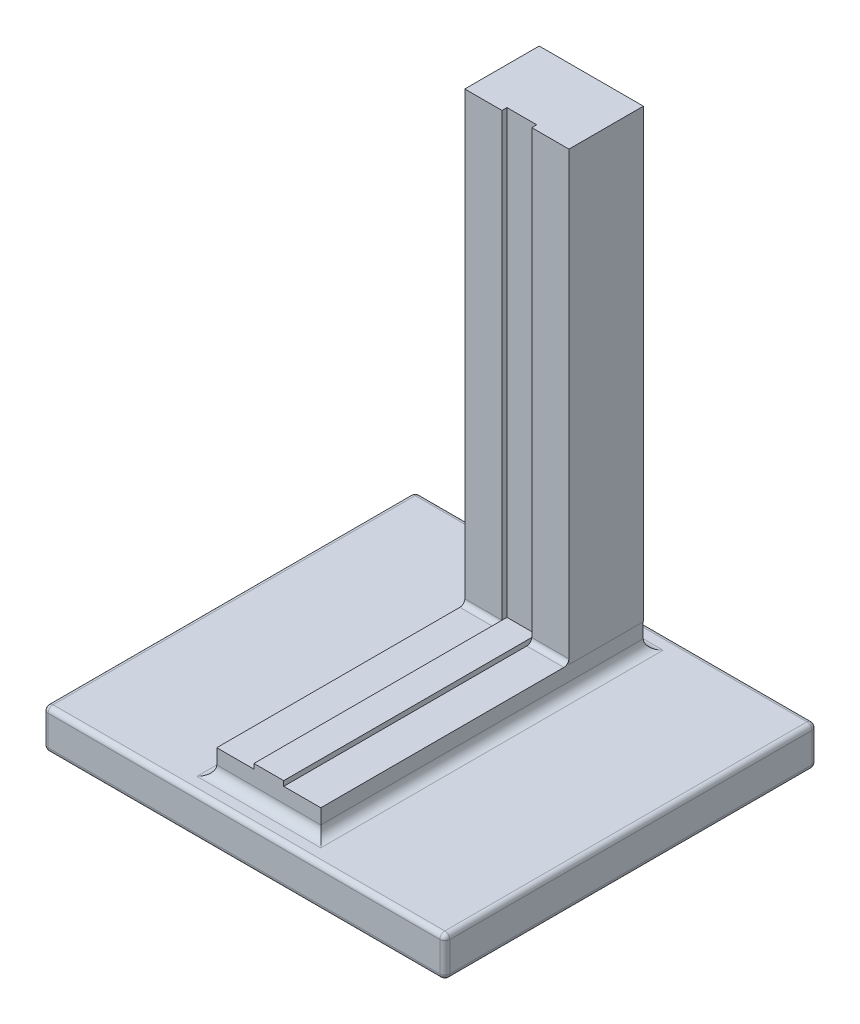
ISO-10303-21;
HEADER;
FILE_DESCRIPTION(('STEP AP214'),'2;1');
FILE_NAME('part.step','',(''),(''),'','','');
FILE_SCHEMA(('AUTOMOTIVE_DESIGN { 1 0 10303 214 1 1 1 1 }'));
ENDSEC;
DATA;
#1=APPLICATION_CONTEXT('core data for automotive mechanical design processes');
#2=APPLICATION_PROTOCOL_DEFINITION('international standard','automotive_design',2000,#1);
#3=PRODUCT_CONTEXT('',#1,'mechanical');
#4=PRODUCT('Part','Part','',(#3));
#5=PRODUCT_RELATED_PRODUCT_CATEGORY('part','',(#4));
#6=PRODUCT_DEFINITION_FORMATION('','',#4);
#7=PRODUCT_DEFINITION_CONTEXT('part definition',#1,'design');
#8=PRODUCT_DEFINITION('design','',#6,#7);
#9=PRODUCT_DEFINITION_SHAPE('','',#8);
#10=(LENGTH_UNIT() NAMED_UNIT(*) SI_UNIT(.MILLI.,.METRE.));
#11=(NAMED_UNIT(*) PLANE_ANGLE_UNIT() SI_UNIT($,.RADIAN.));
#12=(NAMED_UNIT(*) SI_UNIT($,.STERADIAN.) SOLID_ANGLE_UNIT());
#13=UNCERTAINTY_MEASURE_WITH_UNIT(LENGTH_MEASURE(1.E-05),#10,'distance_accuracy_value','');
#14=(GEOMETRIC_REPRESENTATION_CONTEXT(3) GLOBAL_UNCERTAINTY_ASSIGNED_CONTEXT((#13)) GLOBAL_UNIT_ASSIGNED_CONTEXT((#10,
#11,#12)) REPRESENTATION_CONTEXT('',''));
#15=CARTESIAN_POINT('',(0.,0.,0.));
#16=DIRECTION('',(0.,0.,1.));
#17=DIRECTION('',(1.,0.,0.));
#18=AXIS2_PLACEMENT_3D('',#15,#16,#17);
#19=CARTESIAN_POINT('',(0.,0.,1300.));
#20=DIRECTION('',(0.,-1.,0.));
#21=DIRECTION('',(0.,0.,-1.));
#22=AXIS2_PLACEMENT_3D('',#19,#20,#21);
#23=PLANE('',#22);
#24=DIRECTION('',(0.,0.,1.));
#25=VECTOR('',#24,1.);
#26=CARTESIAN_POINT('',(150.,0.,250.));
#27=LINE('',#26,#25);
#28=CARTESIAN_POINT('',(150.,0.,320.));
#29=VERTEX_POINT('',#28);
#30=CARTESIAN_POINT('',(150.,0.,1300.));
#31=VERTEX_POINT('',#30);
#32=EDGE_CURVE('E236',#29,#31,#27,.T.);
#33=ORIENTED_EDGE('',*,*,#32,.F.);
#34=DIRECTION('',(1.,0.,0.));
#35=VECTOR('',#34,1.);
#36=CARTESIAN_POINT('',(0.,0.,320.));
#37=LINE('',#36,#35);
#38=CARTESIAN_POINT('',(0.,0.,320.));
#39=VERTEX_POINT('',#38);
#40=EDGE_CURVE('E342',#29,#39,#37,.F.);
#41=ORIENTED_EDGE('',*,*,#40,.T.);
#42=DIRECTION('',(0.,0.,-1.));
#43=VECTOR('',#42,1.);
#44=CARTESIAN_POINT('',(0.,0.,1300.));
#45=LINE('',#44,#43);
#46=CARTESIAN_POINT('',(0.,0.,1300.));
#47=VERTEX_POINT('',#46);
#48=EDGE_CURVE('E253',#47,#39,#45,.T.);
#49=ORIENTED_EDGE('',*,*,#48,.F.);
#50=DIRECTION('',(-1.,0.,0.));
#51=VECTOR('',#50,1.);
#52=CARTESIAN_POINT('',(0.,0.,1300.));
#53=LINE('',#52,#51);
#54=EDGE_CURVE('E254',#31,#47,#53,.T.);
#55=ORIENTED_EDGE('',*,*,#54,.F.);
#56=EDGE_LOOP('',(#33,#41,#49,#55));
#57=FACE_BOUND('',#56,.T.);
#58=ADVANCED_FACE('F26',(#57),#23,.F.);
#59=CARTESIAN_POINT('',(0.,1800.,300.));
#60=DIRECTION('',(0.,0.,-1.));
#61=DIRECTION('',(-1.,0.,0.));
#62=AXIS2_PLACEMENT_3D('',#59,#60,#61);
#63=PLANE('',#62);
#64=DIRECTION('',(0.,-1.,0.));
#65=VECTOR('',#64,1.);
#66=CARTESIAN_POINT('',(0.,0.,300.));
#67=LINE('',#66,#65);
#68=CARTESIAN_POINT('',(0.,1800.,300.));
#69=VERTEX_POINT('',#68);
#70=CARTESIAN_POINT('',(0.,20.,300.));
#71=VERTEX_POINT('',#70);
#72=EDGE_CURVE('E303',#69,#71,#67,.T.);
#73=ORIENTED_EDGE('',*,*,#72,.T.);
#74=DIRECTION('',(1.,0.,0.));
#75=VECTOR('',#74,1.);
#76=CARTESIAN_POINT('',(150.,20.,300.));
#77=LINE('',#76,#75);
#78=CARTESIAN_POINT('',(150.,20.,300.));
#79=VERTEX_POINT('',#78);
#80=EDGE_CURVE('E337',#71,#79,#77,.T.);
#81=ORIENTED_EDGE('',*,*,#80,.T.);
#82=DIRECTION('',(0.,-1.,0.));
#83=VECTOR('',#82,1.);
#84=CARTESIAN_POINT('',(150.,1800.,300.));
#85=LINE('',#84,#83);
#86=CARTESIAN_POINT('',(150.,1800.,300.));
#87=VERTEX_POINT('',#86);
#88=EDGE_CURVE('E266',#87,#79,#85,.T.);
#89=ORIENTED_EDGE('',*,*,#88,.F.);
#90=DIRECTION('',(-1.,0.,0.));
#91=VECTOR('',#90,1.);
#92=CARTESIAN_POINT('',(0.,1800.,300.));
#93=LINE('',#92,#91);
#94=EDGE_CURVE('E513',#87,#69,#93,.T.);
#95=ORIENTED_EDGE('',*,*,#94,.T.);
#96=EDGE_LOOP('',(#73,#81,#89,#95));
#97=FACE_BOUND('',#96,.T.);
#98=ADVANCED_FACE('F522',(#97),#63,.F.);
#99=CARTESIAN_POINT('',(0.,0.,300.));
#100=DIRECTION('',(1.,0.,0.));
#101=DIRECTION('',(0.,0.,-1.));
#102=AXIS2_PLACEMENT_3D('',#99,#100,#101);
#103=PLANE('',#102);
#104=DIRECTION('',(0.,-1.,0.));
#105=VECTOR('',#104,1.);
#106=CARTESIAN_POINT('',(0.,0.,0.));
#107=LINE('',#106,#105);
#108=CARTESIAN_POINT('',(0.,1800.,0.));
#109=VERTEX_POINT('',#108);
#110=CARTESIAN_POINT('',(0.,-60.,0.));
#111=VERTEX_POINT('',#110);
#112=EDGE_CURVE('E282',#109,#111,#107,.T.);
#113=ORIENTED_EDGE('',*,*,#112,.T.);
#114=DIRECTION('',(0.,0.,-1.));
#115=VECTOR('',#114,1.);
#116=CARTESIAN_POINT('',(0.,-60.,1300.));
#117=LINE('',#116,#115);
#118=CARTESIAN_POINT('',(0.,-60.,1300.));
#119=VERTEX_POINT('',#118);
#120=EDGE_CURVE('E327',#111,#119,#117,.F.);
#121=ORIENTED_EDGE('',*,*,#120,.T.);
#122=DIRECTION('',(0.,-1.,0.));
#123=VECTOR('',#122,1.);
#124=CARTESIAN_POINT('',(0.,0.,1300.));
#125=LINE('',#124,#123);
#126=EDGE_CURVE('E309',#47,#119,#125,.T.);
#127=ORIENTED_EDGE('',*,*,#126,.F.);
#128=ORIENTED_EDGE('',*,*,#48,.T.);
#129=CARTESIAN_POINT('',(0.,20.,320.));
#130=DIRECTION('',(1.,0.,0.));
#131=DIRECTION('',(0.,0.,-1.));
#132=AXIS2_PLACEMENT_3D('',#129,#130,#131);
#133=CIRCLE('',#132,20.);
#134=EDGE_CURVE('E346',#39,#71,#133,.T.);
#135=ORIENTED_EDGE('',*,*,#134,.T.);
#136=ORIENTED_EDGE('',*,*,#72,.F.);
#137=DIRECTION('',(0.,0.,-1.));
#138=VECTOR('',#137,1.);
#139=CARTESIAN_POINT('',(0.,1800.,300.));
#140=LINE('',#139,#138);
#141=EDGE_CURVE('E504',#69,#109,#140,.T.);
#142=ORIENTED_EDGE('',*,*,#141,.T.);
#143=EDGE_LOOP('',(#113,#121,#127,#128,#135,#136,#142));
#144=FACE_BOUND('',#143,.T.);
#145=ADVANCED_FACE('F28',(#144),#103,.F.);
#146=CARTESIAN_POINT('',(0.,0.,300.));
#147=DIRECTION('',(0.,1.,0.));
#148=DIRECTION('',(0.,0.,1.));
#149=AXIS2_PLACEMENT_3D('',#146,#147,#148);
#150=PLANE('',#149);
#151=DIRECTION('',(1.,0.,0.));
#152=VECTOR('',#151,1.);
#153=CARTESIAN_POINT('',(0.,0.,300.));
#154=LINE('',#153,#152);
#155=CARTESIAN_POINT('',(419.479929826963,0.,300.));
#156=VERTEX_POINT('',#155);
#157=CARTESIAN_POINT('',(420.,0.,300.));
#158=VERTEX_POINT('',#157);
#159=EDGE_CURVE('E515',#156,#158,#154,.T.);
#160=ORIENTED_EDGE('',*,*,#159,.F.);
#161=DIRECTION('',(0.,0.,-1.));
#162=VECTOR('',#161,1.);
#163=CARTESIAN_POINT('',(419.479929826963,0.,1300.));
#164=LINE('',#163,#162);
#165=CARTESIAN_POINT('',(419.479929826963,0.,0.));
#166=VERTEX_POINT('',#165);
#167=EDGE_CURVE('E297',#156,#166,#164,.T.);
#168=ORIENTED_EDGE('',*,*,#167,.T.);
#169=DIRECTION('',(1.,0.,0.));
#170=VECTOR('',#169,1.);
#171=CARTESIAN_POINT('',(0.,0.,0.));
#172=LINE('',#171,#170);
#173=CARTESIAN_POINT('',(420.,0.,0.));
#174=VERTEX_POINT('',#173);
#175=EDGE_CURVE('E287',#166,#174,#172,.T.);
#176=ORIENTED_EDGE('',*,*,#175,.T.);
#177=DIRECTION('',(0.,0.,-1.));
#178=VECTOR('',#177,1.);
#179=CARTESIAN_POINT('',(420.,0.,300.));
#180=LINE('',#179,#178);
#181=EDGE_CURVE('E295',#158,#174,#180,.T.);
#182=ORIENTED_EDGE('',*,*,#181,.F.);
#183=EDGE_LOOP('',(#160,#168,#176,#182));
#184=FACE_BOUND('',#183,.T.);
#185=ADVANCED_FACE('F496',(#184),#150,.F.);
#186=CARTESIAN_POINT('',(420.,0.,300.));
#187=DIRECTION('',(-1.,0.,0.));
#188=DIRECTION('',(0.,0.,1.));
#189=AXIS2_PLACEMENT_3D('',#186,#187,#188);
#190=PLANE('',#189);
#191=DIRECTION('',(0.,1.,0.));
#192=VECTOR('',#191,1.);
#193=CARTESIAN_POINT('',(420.,0.,0.));
#194=LINE('',#193,#192);
#195=CARTESIAN_POINT('',(420.,1800.,0.));
#196=VERTEX_POINT('',#195);
#197=EDGE_CURVE('E290',#174,#196,#194,.T.);
#198=ORIENTED_EDGE('',*,*,#197,.T.);
#199=DIRECTION('',(0.,0.,-1.));
#200=VECTOR('',#199,1.);
#201=CARTESIAN_POINT('',(420.,1800.,300.));
#202=LINE('',#201,#200);
#203=CARTESIAN_POINT('',(420.,1800.,300.));
#204=VERTEX_POINT('',#203);
#205=EDGE_CURVE('E503',#204,#196,#202,.T.);
#206=ORIENTED_EDGE('',*,*,#205,.F.);
#207=DIRECTION('',(0.,1.,0.));
#208=VECTOR('',#207,1.);
#209=CARTESIAN_POINT('',(420.,0.,300.));
#210=LINE('',#209,#208);
#211=EDGE_CURVE('E502',#158,#204,#210,.T.);
#212=ORIENTED_EDGE('',*,*,#211,.F.);
#213=ORIENTED_EDGE('',*,*,#181,.T.);
#214=EDGE_LOOP('',(#198,#206,#212,#213));
#215=FACE_BOUND('',#214,.T.);
#216=ADVANCED_FACE('F499',(#215),#190,.F.);
#217=CARTESIAN_POINT('',(0.,1800.,300.));
#218=DIRECTION('',(0.,-1.,0.));
#219=DIRECTION('',(0.,0.,-1.));
#220=AXIS2_PLACEMENT_3D('',#217,#218,#219);
#221=PLANE('',#220);
#222=ORIENTED_EDGE('',*,*,#94,.F.);
#223=DIRECTION('',(0.,0.,1.));
#224=VECTOR('',#223,1.);
#225=CARTESIAN_POINT('',(150.,1800.,280.));
#226=LINE('',#225,#224);
#227=CARTESIAN_POINT('',(150.,1800.,280.));
#228=VERTEX_POINT('',#227);
#229=EDGE_CURVE('E280',#228,#87,#226,.T.);
#230=ORIENTED_EDGE('',*,*,#229,.F.);
#231=DIRECTION('',(-1.,0.,0.));
#232=VECTOR('',#231,1.);
#233=CARTESIAN_POINT('',(150.,1800.,280.));
#234=LINE('',#233,#232);
#235=CARTESIAN_POINT('',(270.,1800.,280.));
#236=VERTEX_POINT('',#235);
#237=EDGE_CURVE('E276',#236,#228,#234,.T.);
#238=ORIENTED_EDGE('',*,*,#237,.F.);
#239=DIRECTION('',(0.,0.,1.));
#240=VECTOR('',#239,1.);
#241=CARTESIAN_POINT('',(270.,1800.,280.));
#242=LINE('',#241,#240);
#243=CARTESIAN_POINT('',(270.,1800.,300.));
#244=VERTEX_POINT('',#243);
#245=EDGE_CURVE('E279',#236,#244,#242,.T.);
#246=ORIENTED_EDGE('',*,*,#245,.T.);
#247=EDGE_CURVE('E508',#204,#244,#93,.T.);
#248=ORIENTED_EDGE('',*,*,#247,.F.);
#249=ORIENTED_EDGE('',*,*,#205,.T.);
#250=DIRECTION('',(-1.,0.,0.));
#251=VECTOR('',#250,1.);
#252=CARTESIAN_POINT('',(0.,1800.,0.));
#253=LINE('',#252,#251);
#254=EDGE_CURVE('E516',#196,#109,#253,.T.);
#255=ORIENTED_EDGE('',*,*,#254,.T.);
#256=ORIENTED_EDGE('',*,*,#141,.F.);
#257=EDGE_LOOP('',(#222,#230,#238,#246,#248,#249,#255,#256));
#258=FACE_BOUND('',#257,.T.);
#259=ADVANCED_FACE('F574',(#258),#221,.F.);
#260=DIRECTION('',(0.,1.,0.));
#261=VECTOR('',#260,1.);
#262=CARTESIAN_POINT('',(270.,1800.,300.));
#263=LINE('',#262,#261);
#264=CARTESIAN_POINT('',(270.,20.,300.));
#265=VERTEX_POINT('',#264);
#266=EDGE_CURVE('E269',#265,#244,#263,.T.);
#267=ORIENTED_EDGE('',*,*,#266,.F.);
#268=DIRECTION('',(1.,0.,0.));
#269=VECTOR('',#268,1.);
#270=CARTESIAN_POINT('',(419.479929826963,20.,300.));
#271=LINE('',#270,#269);
#272=CARTESIAN_POINT('',(419.479929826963,20.,300.));
#273=VERTEX_POINT('',#272);
#274=EDGE_CURVE('E331',#265,#273,#271,.T.);
#275=ORIENTED_EDGE('',*,*,#274,.T.);
#276=DIRECTION('',(0.,-1.,0.));
#277=VECTOR('',#276,1.);
#278=CARTESIAN_POINT('',(419.479929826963,0.,300.));
#279=LINE('',#278,#277);
#280=EDGE_CURVE('E329',#273,#156,#279,.T.);
#281=ORIENTED_EDGE('',*,*,#280,.T.);
#282=ORIENTED_EDGE('',*,*,#159,.T.);
#283=ORIENTED_EDGE('',*,*,#211,.T.);
#284=ORIENTED_EDGE('',*,*,#247,.T.);
#285=EDGE_LOOP('',(#267,#275,#281,#282,#283,#284));
#286=FACE_BOUND('',#285,.T.);
#287=ADVANCED_FACE('F543',(#286),#63,.F.);
#288=CARTESIAN_POINT('',(0.,1800.,0.));
#289=DIRECTION('',(0.,0.,-1.));
#290=DIRECTION('',(-1.,0.,0.));
#291=AXIS2_PLACEMENT_3D('',#288,#289,#290);
#292=PLANE('',#291);
#293=DIRECTION('',(0.,1.,0.));
#294=VECTOR('',#293,1.);
#295=CARTESIAN_POINT('',(419.479929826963,0.,0.));
#296=LINE('',#295,#294);
#297=CARTESIAN_POINT('',(419.479929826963,-60.,0.));
#298=VERTEX_POINT('',#297);
#299=EDGE_CURVE('E306',#298,#166,#296,.T.);
#300=ORIENTED_EDGE('',*,*,#299,.F.);
#301=DIRECTION('',(1.,0.,0.));
#302=VECTOR('',#301,1.);
#303=CARTESIAN_POINT('',(0.,-60.0000000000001,0.));
#304=LINE('',#303,#302);
#305=EDGE_CURVE('E323',#298,#111,#304,.F.);
#306=ORIENTED_EDGE('',*,*,#305,.T.);
#307=ORIENTED_EDGE('',*,*,#112,.F.);
#308=ORIENTED_EDGE('',*,*,#254,.F.);
#309=ORIENTED_EDGE('',*,*,#197,.F.);
#310=ORIENTED_EDGE('',*,*,#175,.F.);
#311=EDGE_LOOP('',(#300,#306,#307,#308,#309,#310));
#312=FACE_BOUND('',#311,.T.);
#313=ADVANCED_FACE('F488',(#312),#292,.T.);
#314=CARTESIAN_POINT('',(150.,1800.,280.));
#315=DIRECTION('',(-1.,0.,0.));
#316=DIRECTION('',(0.,-1.,0.));
#317=AXIS2_PLACEMENT_3D('',#314,#315,#316);
#318=PLANE('',#317);
#319=ORIENTED_EDGE('',*,*,#88,.T.);
#320=DIRECTION('',(0.,0.,1.));
#321=VECTOR('',#320,1.);
#322=CARTESIAN_POINT('',(150.,20.,250.));
#323=LINE('',#322,#321);
#324=CARTESIAN_POINT('',(150.,20.,280.));
#325=VERTEX_POINT('',#324);
#326=EDGE_CURVE('E310',#325,#79,#323,.T.);
#327=ORIENTED_EDGE('',*,*,#326,.F.);
#328=DIRECTION('',(0.,-1.,0.));
#329=VECTOR('',#328,1.);
#330=CARTESIAN_POINT('',(150.,1800.,280.));
#331=LINE('',#330,#329);
#332=EDGE_CURVE('E271',#228,#325,#331,.T.);
#333=ORIENTED_EDGE('',*,*,#332,.F.);
#334=ORIENTED_EDGE('',*,*,#229,.T.);
#335=EDGE_LOOP('',(#319,#327,#333,#334));
#336=FACE_BOUND('',#335,.T.);
#337=ADVANCED_FACE('F567',(#336),#318,.F.);
#338=CARTESIAN_POINT('',(270.,1800.,280.));
#339=DIRECTION('',(1.,0.,0.));
#340=DIRECTION('',(0.,1.,0.));
#341=AXIS2_PLACEMENT_3D('',#338,#339,#340);
#342=PLANE('',#341);
#343=DIRECTION('',(0.,1.,0.));
#344=VECTOR('',#343,1.);
#345=CARTESIAN_POINT('',(270.,1800.,280.));
#346=LINE('',#345,#344);
#347=CARTESIAN_POINT('',(270.,20.,280.));
#348=VERTEX_POINT('',#347);
#349=EDGE_CURVE('E274',#348,#236,#346,.T.);
#350=ORIENTED_EDGE('',*,*,#349,.F.);
#351=DIRECTION('',(0.,0.,1.));
#352=VECTOR('',#351,1.);
#353=CARTESIAN_POINT('',(270.,20.,250.));
#354=LINE('',#353,#352);
#355=EDGE_CURVE('E459',#348,#265,#354,.T.);
#356=ORIENTED_EDGE('',*,*,#355,.T.);
#357=ORIENTED_EDGE('',*,*,#266,.T.);
#358=ORIENTED_EDGE('',*,*,#245,.F.);
#359=EDGE_LOOP('',(#350,#356,#357,#358));
#360=FACE_BOUND('',#359,.T.);
#361=ADVANCED_FACE('F562',(#360),#342,.F.);
#362=CARTESIAN_POINT('',(150.,0.,280.));
#363=DIRECTION('',(0.,0.,1.));
#364=DIRECTION('',(1.,0.,0.));
#365=AXIS2_PLACEMENT_3D('',#362,#363,#364);
#366=PLANE('',#365);
#367=DIRECTION('',(-1.,0.,0.));
#368=VECTOR('',#367,1.);
#369=CARTESIAN_POINT('',(150.,20.,280.));
#370=LINE('',#369,#368);
#371=EDGE_CURVE('E300',#348,#325,#370,.T.);
#372=ORIENTED_EDGE('',*,*,#371,.F.);
#373=ORIENTED_EDGE('',*,*,#349,.T.);
#374=ORIENTED_EDGE('',*,*,#237,.T.);
#375=ORIENTED_EDGE('',*,*,#332,.T.);
#376=EDGE_LOOP('',(#372,#373,#374,#375));
#377=FACE_BOUND('',#376,.T.);
#378=ADVANCED_FACE('F557',(#377),#366,.T.);
#379=CARTESIAN_POINT('',(419.479929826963,0.,1300.));
#380=DIRECTION('',(-1.,0.,0.));
#381=DIRECTION('',(0.,-1.,0.));
#382=AXIS2_PLACEMENT_3D('',#379,#380,#381);
#383=PLANE('',#382);
#384=DIRECTION('',(0.,1.,0.));
#385=VECTOR('',#384,1.);
#386=CARTESIAN_POINT('',(419.479929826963,0.,1300.));
#387=LINE('',#386,#385);
#388=CARTESIAN_POINT('',(419.479929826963,-60.,1300.));
#389=VERTEX_POINT('',#388);
#390=CARTESIAN_POINT('',(419.479929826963,0.,1300.));
#391=VERTEX_POINT('',#390);
#392=EDGE_CURVE('E251',#389,#391,#387,.T.);
#393=ORIENTED_EDGE('',*,*,#392,.F.);
#394=DIRECTION('',(0.,0.,-1.));
#395=VECTOR('',#394,1.);
#396=CARTESIAN_POINT('',(419.479929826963,-60.,0.));
#397=LINE('',#396,#395);
#398=EDGE_CURVE('E311',#389,#298,#397,.T.);
#399=ORIENTED_EDGE('',*,*,#398,.T.);
#400=ORIENTED_EDGE('',*,*,#299,.T.);
#401=ORIENTED_EDGE('',*,*,#167,.F.);
#402=ORIENTED_EDGE('',*,*,#280,.F.);
#403=CARTESIAN_POINT('',(419.479929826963,20.,320.));
#404=DIRECTION('',(-1.,0.,0.));
#405=DIRECTION('',(0.,-1.,0.));
#406=AXIS2_PLACEMENT_3D('',#403,#404,#405);
#407=CIRCLE('',#406,20.);
#408=CARTESIAN_POINT('',(419.479929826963,0.,320.));
#409=VERTEX_POINT('',#408);
#410=EDGE_CURVE('E344',#273,#409,#407,.T.);
#411=ORIENTED_EDGE('',*,*,#410,.T.);
#412=EDGE_CURVE('E257',#391,#409,#164,.T.);
#413=ORIENTED_EDGE('',*,*,#412,.F.);
#414=EDGE_LOOP('',(#393,#399,#400,#401,#402,#411,#413));
#415=FACE_BOUND('',#414,.T.);
#416=ADVANCED_FACE('F484',(#415),#383,.F.);
#417=ORIENTED_EDGE('',*,*,#412,.T.);
#418=DIRECTION('',(1.,0.,0.));
#419=VECTOR('',#418,1.);
#420=CARTESIAN_POINT('',(270.,0.,320.));
#421=LINE('',#420,#419);
#422=CARTESIAN_POINT('',(270.,0.,320.));
#423=VERTEX_POINT('',#422);
#424=EDGE_CURVE('E232',#409,#423,#421,.F.);
#425=ORIENTED_EDGE('',*,*,#424,.T.);
#426=DIRECTION('',(0.,0.,1.));
#427=VECTOR('',#426,1.);
#428=CARTESIAN_POINT('',(270.,0.,250.));
#429=LINE('',#428,#427);
#430=CARTESIAN_POINT('',(270.,0.,1300.));
#431=VERTEX_POINT('',#430);
#432=EDGE_CURVE('E225',#423,#431,#429,.T.);
#433=ORIENTED_EDGE('',*,*,#432,.T.);
#434=EDGE_CURVE('E230',#391,#431,#53,.T.);
#435=ORIENTED_EDGE('',*,*,#434,.F.);
#436=EDGE_LOOP('',(#417,#425,#433,#435));
#437=FACE_BOUND('',#436,.T.);
#438=ADVANCED_FACE('F228',(#437),#23,.F.);
#439=CARTESIAN_POINT('',(0.,0.,1300.));
#440=DIRECTION('',(0.,0.,1.));
#441=DIRECTION('',(1.,0.,0.));
#442=AXIS2_PLACEMENT_3D('',#439,#440,#441);
#443=PLANE('',#442);
#444=ORIENTED_EDGE('',*,*,#126,.T.);
#445=DIRECTION('',(1.,0.,0.));
#446=VECTOR('',#445,1.);
#447=CARTESIAN_POINT('',(0.,-60.,1300.));
#448=LINE('',#447,#446);
#449=EDGE_CURVE('E325',#119,#389,#448,.T.);
#450=ORIENTED_EDGE('',*,*,#449,.T.);
#451=ORIENTED_EDGE('',*,*,#392,.T.);
#452=ORIENTED_EDGE('',*,*,#434,.T.);
#453=DIRECTION('',(0.,1.,0.));
#454=VECTOR('',#453,1.);
#455=CARTESIAN_POINT('',(270.,0.,1300.));
#456=LINE('',#455,#454);
#457=CARTESIAN_POINT('',(270.,20.,1300.));
#458=VERTEX_POINT('',#457);
#459=EDGE_CURVE('E239',#431,#458,#456,.T.);
#460=ORIENTED_EDGE('',*,*,#459,.T.);
#461=DIRECTION('',(-1.,0.,0.));
#462=VECTOR('',#461,1.);
#463=CARTESIAN_POINT('',(150.,20.,1300.));
#464=LINE('',#463,#462);
#465=CARTESIAN_POINT('',(150.,20.,1300.));
#466=VERTEX_POINT('',#465);
#467=EDGE_CURVE('E245',#458,#466,#464,.T.);
#468=ORIENTED_EDGE('',*,*,#467,.T.);
#469=DIRECTION('',(0.,-1.,0.));
#470=VECTOR('',#469,1.);
#471=CARTESIAN_POINT('',(150.,0.,1300.));
#472=LINE('',#471,#470);
#473=EDGE_CURVE('E246',#466,#31,#472,.T.);
#474=ORIENTED_EDGE('',*,*,#473,.T.);
#475=ORIENTED_EDGE('',*,*,#54,.T.);
#476=EDGE_LOOP('',(#444,#450,#451,#452,#460,#468,#474,#475));
#477=FACE_BOUND('',#476,.T.);
#478=ADVANCED_FACE('F249',(#477),#443,.T.);
#479=CARTESIAN_POINT('',(150.,0.,250.));
#480=DIRECTION('',(-1.,0.,0.));
#481=DIRECTION('',(0.,0.,1.));
#482=AXIS2_PLACEMENT_3D('',#479,#480,#481);
#483=PLANE('',#482);
#484=EDGE_CURVE('E457',#79,#466,#323,.T.);
#485=ORIENTED_EDGE('',*,*,#484,.F.);
#486=CARTESIAN_POINT('',(150.,20.,320.));
#487=DIRECTION('',(-1.,0.,0.));
#488=DIRECTION('',(0.,0.,1.));
#489=AXIS2_PLACEMENT_3D('',#486,#487,#488);
#490=CIRCLE('',#489,20.);
#491=EDGE_CURVE('E340',#79,#29,#490,.T.);
#492=ORIENTED_EDGE('',*,*,#491,.T.);
#493=ORIENTED_EDGE('',*,*,#32,.T.);
#494=ORIENTED_EDGE('',*,*,#473,.F.);
#495=EDGE_LOOP('',(#485,#492,#493,#494));
#496=FACE_BOUND('',#495,.T.);
#497=ADVANCED_FACE('F532',(#496),#483,.T.);
#498=CARTESIAN_POINT('',(270.,0.,250.));
#499=DIRECTION('',(1.,0.,0.));
#500=DIRECTION('',(0.,0.,-1.));
#501=AXIS2_PLACEMENT_3D('',#498,#499,#500);
#502=PLANE('',#501);
#503=ORIENTED_EDGE('',*,*,#432,.F.);
#504=CARTESIAN_POINT('',(270.,20.,320.));
#505=DIRECTION('',(1.,0.,0.));
#506=DIRECTION('',(0.,0.,-1.));
#507=AXIS2_PLACEMENT_3D('',#504,#505,#506);
#508=CIRCLE('',#507,20.);
#509=EDGE_CURVE('E335',#423,#265,#508,.T.);
#510=ORIENTED_EDGE('',*,*,#509,.T.);
#511=EDGE_CURVE('E235',#265,#458,#354,.T.);
#512=ORIENTED_EDGE('',*,*,#511,.T.);
#513=ORIENTED_EDGE('',*,*,#459,.F.);
#514=EDGE_LOOP('',(#503,#510,#512,#513));
#515=FACE_BOUND('',#514,.T.);
#516=ADVANCED_FACE('F240',(#515),#502,.T.);
#517=CARTESIAN_POINT('',(150.,20.,250.));
#518=DIRECTION('',(0.,1.,0.));
#519=DIRECTION('',(0.,0.,1.));
#520=AXIS2_PLACEMENT_3D('',#517,#518,#519);
#521=PLANE('',#520);
#522=ORIENTED_EDGE('',*,*,#355,.F.);
#523=ORIENTED_EDGE('',*,*,#371,.T.);
#524=ORIENTED_EDGE('',*,*,#326,.T.);
#525=ORIENTED_EDGE('',*,*,#484,.T.);
#526=ORIENTED_EDGE('',*,*,#467,.F.);
#527=ORIENTED_EDGE('',*,*,#511,.F.);
#528=EDGE_LOOP('',(#522,#523,#524,#525,#526,#527));
#529=FACE_BOUND('',#528,.T.);
#530=ADVANCED_FACE('F809',(#529),#521,.T.);
#531=CARTESIAN_POINT('',(-600.,-100.,-100.));
#532=DIRECTION('',(0.,-1.,0.));
#533=DIRECTION('',(0.,0.,-1.));
#534=AXIS2_PLACEMENT_3D('',#531,#532,#533);
#535=PLANE('',#534);
#536=DIRECTION('',(-1.,0.,0.));
#537=VECTOR('',#536,1.);
#538=CARTESIAN_POINT('',(-600.,-100.,1380.));
#539=LINE('',#538,#537);
#540=CARTESIAN_POINT('',(-580.,-100.,1380.));
#541=VERTEX_POINT('',#540);
#542=CARTESIAN_POINT('',(999.479929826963,-100.,1380.));
#543=VERTEX_POINT('',#542);
#544=EDGE_CURVE('E48',#541,#543,#539,.F.);
#545=ORIENTED_EDGE('',*,*,#544,.T.);
#546=DIRECTION('',(0.,0.,1.));
#547=VECTOR('',#546,1.);
#548=CARTESIAN_POINT('',(999.479929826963,-100.,-99.9999999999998));
#549=LINE('',#548,#547);
#550=CARTESIAN_POINT('',(999.479929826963,-100.,-80.));
#551=VERTEX_POINT('',#550);
#552=EDGE_CURVE('E11',#543,#551,#549,.F.);
#553=ORIENTED_EDGE('',*,*,#552,.T.);
#554=DIRECTION('',(1.,0.,0.));
#555=VECTOR('',#554,1.);
#556=CARTESIAN_POINT('',(-600.,-100.,-80.));
#557=LINE('',#556,#555);
#558=CARTESIAN_POINT('',(-580.,-100.,-80.));
#559=VERTEX_POINT('',#558);
#560=EDGE_CURVE('E34',#551,#559,#557,.F.);
#561=ORIENTED_EDGE('',*,*,#560,.T.);
#562=DIRECTION('',(0.,0.,-1.));
#563=VECTOR('',#562,1.);
#564=CARTESIAN_POINT('',(-580.,-100.,-100.));
#565=LINE('',#564,#563);
#566=EDGE_CURVE('E393',#559,#541,#565,.F.);
#567=ORIENTED_EDGE('',*,*,#566,.T.);
#568=EDGE_LOOP('',(#545,#553,#561,#567));
#569=FACE_BOUND('',#568,.T.);
#570=DIRECTION('',(1.,0.,0.));
#571=VECTOR('',#570,1.);
#572=CARTESIAN_POINT('',(-600.,-100.,-40.));
#573=LINE('',#572,#571);
#574=CARTESIAN_POINT('',(-40.,-100.,-40.));
#575=VERTEX_POINT('',#574);
#576=CARTESIAN_POINT('',(459.479929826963,-100.,-40.));
#577=VERTEX_POINT('',#576);
#578=EDGE_CURVE('E318',#575,#577,#573,.T.);
#579=ORIENTED_EDGE('',*,*,#578,.T.);
#580=DIRECTION('',(0.,0.,-1.));
#581=VECTOR('',#580,1.);
#582=CARTESIAN_POINT('',(459.479929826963,-100.,1300.));
#583=LINE('',#582,#581);
#584=CARTESIAN_POINT('',(459.479929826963,-100.,1340.));
#585=VERTEX_POINT('',#584);
#586=EDGE_CURVE('E320',#577,#585,#583,.F.);
#587=ORIENTED_EDGE('',*,*,#586,.T.);
#588=DIRECTION('',(1.,0.,0.));
#589=VECTOR('',#588,1.);
#590=CARTESIAN_POINT('',(-600.,-100.,1340.));
#591=LINE('',#590,#589);
#592=CARTESIAN_POINT('',(-40.,-100.,1340.));
#593=VERTEX_POINT('',#592);
#594=EDGE_CURVE('E316',#585,#593,#591,.F.);
#595=ORIENTED_EDGE('',*,*,#594,.T.);
#596=DIRECTION('',(0.,0.,-1.));
#597=VECTOR('',#596,1.);
#598=CARTESIAN_POINT('',(-40.,-100.,0.));
#599=LINE('',#598,#597);
#600=EDGE_CURVE('E314',#593,#575,#599,.T.);
#601=ORIENTED_EDGE('',*,*,#600,.T.);
#602=EDGE_LOOP('',(#579,#587,#595,#601));
#603=FACE_BOUND('',#602,.T.);
#604=ADVANCED_FACE('F397',(#569,#603),#535,.F.);
#605=CARTESIAN_POINT('',(-600.,-260.,1400.));
#606=DIRECTION('',(1.,0.,0.));
#607=DIRECTION('',(0.,0.,-1.));
#608=AXIS2_PLACEMENT_3D('',#605,#606,#607);
#609=PLANE('',#608);
#610=DIRECTION('',(0.,1.,0.));
#611=VECTOR('',#610,1.);
#612=CARTESIAN_POINT('',(-600.,-260.,-80.0000000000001));
#613=LINE('',#612,#611);
#614=CARTESIAN_POINT('',(-600.,-120.,-80.));
#615=VERTEX_POINT('',#614);
#616=CARTESIAN_POINT('',(-600.,-240.,-80.));
#617=VERTEX_POINT('',#616);
#618=EDGE_CURVE('E388',#615,#617,#613,.F.);
#619=ORIENTED_EDGE('',*,*,#618,.T.);
#620=DIRECTION('',(0.,0.,-1.));
#621=VECTOR('',#620,1.);
#622=CARTESIAN_POINT('',(-600.,-240.,1400.));
#623=LINE('',#622,#621);
#624=CARTESIAN_POINT('',(-600.,-240.,1380.));
#625=VERTEX_POINT('',#624);
#626=EDGE_CURVE('E390',#617,#625,#623,.F.);
#627=ORIENTED_EDGE('',*,*,#626,.T.);
#628=DIRECTION('',(0.,1.,0.));
#629=VECTOR('',#628,1.);
#630=CARTESIAN_POINT('',(-600.,-260.,1380.));
#631=LINE('',#630,#629);
#632=CARTESIAN_POINT('',(-600.,-120.,1380.));
#633=VERTEX_POINT('',#632);
#634=EDGE_CURVE('E386',#625,#633,#631,.T.);
#635=ORIENTED_EDGE('',*,*,#634,.T.);
#636=DIRECTION('',(0.,0.,-1.));
#637=VECTOR('',#636,1.);
#638=CARTESIAN_POINT('',(-600.,-120.,1400.));
#639=LINE('',#638,#637);
#640=EDGE_CURVE('E384',#633,#615,#639,.T.);
#641=ORIENTED_EDGE('',*,*,#640,.T.);
#642=EDGE_LOOP('',(#619,#627,#635,#641));
#643=FACE_BOUND('',#642,.T.);
#644=ADVANCED_FACE('F808',(#643),#609,.F.);
#645=CARTESIAN_POINT('',(-600.,-260.,-100.));
#646=DIRECTION('',(0.,0.,1.));
#647=DIRECTION('',(1.,0.,0.));
#648=AXIS2_PLACEMENT_3D('',#645,#646,#647);
#649=PLANE('',#648);
#650=DIRECTION('',(0.,1.,0.));
#651=VECTOR('',#650,1.);
#652=CARTESIAN_POINT('',(999.479929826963,-260.,-100.));
#653=LINE('',#652,#651);
#654=CARTESIAN_POINT('',(999.479929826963,-120.,-100.));
#655=VERTEX_POINT('',#654);
#656=CARTESIAN_POINT('',(999.479929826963,-240.,-100.));
#657=VERTEX_POINT('',#656);
#658=EDGE_CURVE('E361',#655,#657,#653,.F.);
#659=ORIENTED_EDGE('',*,*,#658,.T.);
#660=DIRECTION('',(1.,0.,0.));
#661=VECTOR('',#660,1.);
#662=CARTESIAN_POINT('',(-600.,-240.,-100.));
#663=LINE('',#662,#661);
#664=CARTESIAN_POINT('',(-580.,-240.,-100.));
#665=VERTEX_POINT('',#664);
#666=EDGE_CURVE('E363',#657,#665,#663,.F.);
#667=ORIENTED_EDGE('',*,*,#666,.T.);
#668=DIRECTION('',(0.,1.,0.));
#669=VECTOR('',#668,1.);
#670=CARTESIAN_POINT('',(-580.,-260.,-100.));
#671=LINE('',#670,#669);
#672=CARTESIAN_POINT('',(-580.,-120.,-100.));
#673=VERTEX_POINT('',#672);
#674=EDGE_CURVE('E359',#665,#673,#671,.T.);
#675=ORIENTED_EDGE('',*,*,#674,.T.);
#676=DIRECTION('',(1.,0.,0.));
#677=VECTOR('',#676,1.);
#678=CARTESIAN_POINT('',(-600.,-120.,-100.));
#679=LINE('',#678,#677);
#680=EDGE_CURVE('E357',#673,#655,#679,.T.);
#681=ORIENTED_EDGE('',*,*,#680,.T.);
#682=EDGE_LOOP('',(#659,#667,#675,#681));
#683=FACE_BOUND('',#682,.T.);
#684=ADVANCED_FACE('F819',(#683),#649,.F.);
#685=CARTESIAN_POINT('',(1019.47992982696,-260.,1400.));
#686=DIRECTION('',(-1.,0.,0.));
#687=DIRECTION('',(0.,0.,1.));
#688=AXIS2_PLACEMENT_3D('',#685,#686,#687);
#689=PLANE('',#688);
#690=DIRECTION('',(0.,0.,1.));
#691=VECTOR('',#690,1.);
#692=CARTESIAN_POINT('',(1019.47992982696,-240.,-100.));
#693=LINE('',#692,#691);
#694=CARTESIAN_POINT('',(1019.47992982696,-240.,1380.));
#695=VERTEX_POINT('',#694);
#696=CARTESIAN_POINT('',(1019.47992982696,-240.,-80.0000000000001));
#697=VERTEX_POINT('',#696);
#698=EDGE_CURVE('E370',#695,#697,#693,.F.);
#699=ORIENTED_EDGE('',*,*,#698,.T.);
#700=DIRECTION('',(0.,1.,0.));
#701=VECTOR('',#700,1.);
#702=CARTESIAN_POINT('',(1019.47992982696,-260.,-80.0000000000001));
#703=LINE('',#702,#701);
#704=CARTESIAN_POINT('',(1019.47992982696,-120.,-80.0000000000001));
#705=VERTEX_POINT('',#704);
#706=EDGE_CURVE('E372',#697,#705,#703,.T.);
#707=ORIENTED_EDGE('',*,*,#706,.T.);
#708=DIRECTION('',(0.,0.,1.));
#709=VECTOR('',#708,1.);
#710=CARTESIAN_POINT('',(1019.47992982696,-120.,1400.));
#711=LINE('',#710,#709);
#712=CARTESIAN_POINT('',(1019.47992982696,-120.,1380.));
#713=VERTEX_POINT('',#712);
#714=EDGE_CURVE('E366',#705,#713,#711,.T.);
#715=ORIENTED_EDGE('',*,*,#714,.T.);
#716=DIRECTION('',(0.,1.,0.));
#717=VECTOR('',#716,1.);
#718=CARTESIAN_POINT('',(1019.47992982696,-260.,1380.));
#719=LINE('',#718,#717);
#720=EDGE_CURVE('E368',#713,#695,#719,.F.);
#721=ORIENTED_EDGE('',*,*,#720,.T.);
#722=EDGE_LOOP('',(#699,#707,#715,#721));
#723=FACE_BOUND('',#722,.T.);
#724=ADVANCED_FACE('F815',(#723),#689,.F.);
#725=CARTESIAN_POINT('',(-600.,-260.,1400.));
#726=DIRECTION('',(0.,0.,-1.));
#727=DIRECTION('',(-1.,0.,0.));
#728=AXIS2_PLACEMENT_3D('',#725,#726,#727);
#729=PLANE('',#728);
#730=DIRECTION('',(-1.,0.,0.));
#731=VECTOR('',#730,1.);
#732=CARTESIAN_POINT('',(1019.47992982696,-240.,1400.));
#733=LINE('',#732,#731);
#734=CARTESIAN_POINT('',(-580.,-240.,1400.));
#735=VERTEX_POINT('',#734);
#736=CARTESIAN_POINT('',(999.479929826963,-240.,1400.));
#737=VERTEX_POINT('',#736);
#738=EDGE_CURVE('E379',#735,#737,#733,.F.);
#739=ORIENTED_EDGE('',*,*,#738,.T.);
#740=DIRECTION('',(0.,1.,0.));
#741=VECTOR('',#740,1.);
#742=CARTESIAN_POINT('',(999.479929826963,-260.,1400.));
#743=LINE('',#742,#741);
#744=CARTESIAN_POINT('',(999.479929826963,-120.,1400.));
#745=VERTEX_POINT('',#744);
#746=EDGE_CURVE('E381',#737,#745,#743,.T.);
#747=ORIENTED_EDGE('',*,*,#746,.T.);
#748=DIRECTION('',(-1.,0.,0.));
#749=VECTOR('',#748,1.);
#750=CARTESIAN_POINT('',(-600.,-120.,1400.));
#751=LINE('',#750,#749);
#752=CARTESIAN_POINT('',(-580.,-120.,1400.));
#753=VERTEX_POINT('',#752);
#754=EDGE_CURVE('E375',#745,#753,#751,.T.);
#755=ORIENTED_EDGE('',*,*,#754,.T.);
#756=DIRECTION('',(0.,1.,0.));
#757=VECTOR('',#756,1.);
#758=CARTESIAN_POINT('',(-580.,-260.,1400.));
#759=LINE('',#758,#757);
#760=EDGE_CURVE('E377',#753,#735,#759,.F.);
#761=ORIENTED_EDGE('',*,*,#760,.T.);
#762=EDGE_LOOP('',(#739,#747,#755,#761));
#763=FACE_BOUND('',#762,.T.);
#764=ADVANCED_FACE('F811',(#763),#729,.F.);
#765=CARTESIAN_POINT('',(-600.,-260.,-100.));
#766=DIRECTION('',(0.,-1.,0.));
#767=DIRECTION('',(0.,0.,-1.));
#768=AXIS2_PLACEMENT_3D('',#765,#766,#767);
#769=PLANE('',#768);
#770=DIRECTION('',(0.,0.,-1.));
#771=VECTOR('',#770,1.);
#772=CARTESIAN_POINT('',(-580.,-260.,-100.));
#773=LINE('',#772,#771);
#774=CARTESIAN_POINT('',(-580.,-260.,1380.));
#775=VERTEX_POINT('',#774);
#776=CARTESIAN_POINT('',(-580.,-260.,-80.));
#777=VERTEX_POINT('',#776);
#778=EDGE_CURVE('E348',#775,#777,#773,.T.);
#779=ORIENTED_EDGE('',*,*,#778,.T.);
#780=DIRECTION('',(1.,0.,0.));
#781=VECTOR('',#780,1.);
#782=CARTESIAN_POINT('',(1019.47992982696,-260.,-80.));
#783=LINE('',#782,#781);
#784=CARTESIAN_POINT('',(999.479929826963,-260.,-80.));
#785=VERTEX_POINT('',#784);
#786=EDGE_CURVE('E354',#777,#785,#783,.T.);
#787=ORIENTED_EDGE('',*,*,#786,.T.);
#788=DIRECTION('',(0.,0.,1.));
#789=VECTOR('',#788,1.);
#790=CARTESIAN_POINT('',(999.479929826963,-260.,1400.));
#791=LINE('',#790,#789);
#792=CARTESIAN_POINT('',(999.479929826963,-260.,1380.));
#793=VERTEX_POINT('',#792);
#794=EDGE_CURVE('E352',#785,#793,#791,.T.);
#795=ORIENTED_EDGE('',*,*,#794,.T.);
#796=DIRECTION('',(-1.,0.,0.));
#797=VECTOR('',#796,1.);
#798=CARTESIAN_POINT('',(-600.,-260.,1380.));
#799=LINE('',#798,#797);
#800=EDGE_CURVE('E350',#793,#775,#799,.T.);
#801=ORIENTED_EDGE('',*,*,#800,.T.);
#802=EDGE_LOOP('',(#779,#787,#795,#801));
#803=FACE_BOUND('',#802,.T.);
#804=ADVANCED_FACE('F613',(#803),#769,.T.);
#805=CARTESIAN_POINT('',(-40.,-60.,-100.));
#806=DIRECTION('',(0.,0.,1.));
#807=DIRECTION('',(1.,0.,0.));
#808=AXIS2_PLACEMENT_3D('',#805,#806,#807);
#809=CYLINDRICAL_SURFACE('',#808,40.);
#810=CARTESIAN_POINT('',(-40.,-60.,-40.));
#811=DIRECTION('',(-0.707106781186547,0.,0.707106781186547));
#812=DIRECTION('',(0.707106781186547,0.,0.707106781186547));
#813=AXIS2_PLACEMENT_3D('',#810,#811,#812);
#814=ELLIPSE('',#813,56.5685424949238,40.);
#815=EDGE_CURVE('E448',#575,#111,#814,.T.);
#816=ORIENTED_EDGE('',*,*,#815,.F.);
#817=ORIENTED_EDGE('',*,*,#600,.F.);
#818=CARTESIAN_POINT('',(-40.,-60.,1340.));
#819=DIRECTION('',(0.707106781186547,0.,0.707106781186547));
#820=DIRECTION('',(-0.707106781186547,0.,0.707106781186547));
#821=AXIS2_PLACEMENT_3D('',#818,#819,#820);
#822=ELLIPSE('',#821,56.5685424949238,40.);
#823=EDGE_CURVE('E451',#119,#593,#822,.F.);
#824=ORIENTED_EDGE('',*,*,#823,.F.);
#825=ORIENTED_EDGE('',*,*,#120,.F.);
#826=EDGE_LOOP('',(#816,#817,#824,#825));
#827=FACE_BOUND('',#826,.T.);
#828=ADVANCED_FACE('F471',(#827),#809,.F.);
#829=CARTESIAN_POINT('',(0.,-60.,1340.));
#830=DIRECTION('',(1.,0.,0.));
#831=DIRECTION('',(0.,0.,-1.));
#832=AXIS2_PLACEMENT_3D('',#829,#830,#831);
#833=CYLINDRICAL_SURFACE('',#832,40.);
#834=ORIENTED_EDGE('',*,*,#823,.T.);
#835=ORIENTED_EDGE('',*,*,#594,.F.);
#836=CARTESIAN_POINT('',(459.479929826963,-60.,1340.));
#837=DIRECTION('',(0.707106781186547,0.,-0.707106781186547));
#838=DIRECTION('',(0.707106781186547,0.,0.707106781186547));
#839=AXIS2_PLACEMENT_3D('',#836,#837,#838);
#840=ELLIPSE('',#839,56.5685424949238,40.);
#841=EDGE_CURVE('E446',#389,#585,#840,.F.);
#842=ORIENTED_EDGE('',*,*,#841,.F.);
#843=ORIENTED_EDGE('',*,*,#449,.F.);
#844=EDGE_LOOP('',(#834,#835,#842,#843));
#845=FACE_BOUND('',#844,.T.);
#846=ADVANCED_FACE('F475',(#845),#833,.F.);
#847=CARTESIAN_POINT('',(-600.,-60.,-40.));
#848=DIRECTION('',(1.,0.,0.));
#849=DIRECTION('',(0.,0.,-1.));
#850=AXIS2_PLACEMENT_3D('',#847,#848,#849);
#851=CYLINDRICAL_SURFACE('',#850,40.);
#852=ORIENTED_EDGE('',*,*,#815,.T.);
#853=ORIENTED_EDGE('',*,*,#305,.F.);
#854=CARTESIAN_POINT('',(459.479929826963,-60.,-40.));
#855=DIRECTION('',(0.707106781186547,0.,0.707106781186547));
#856=DIRECTION('',(0.707106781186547,0.,-0.707106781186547));
#857=AXIS2_PLACEMENT_3D('',#854,#855,#856);
#858=ELLIPSE('',#857,56.5685424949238,40.);
#859=EDGE_CURVE('E444',#577,#298,#858,.F.);
#860=ORIENTED_EDGE('',*,*,#859,.F.);
#861=ORIENTED_EDGE('',*,*,#578,.F.);
#862=EDGE_LOOP('',(#852,#853,#860,#861));
#863=FACE_BOUND('',#862,.T.);
#864=ADVANCED_FACE('F621',(#863),#851,.F.);
#865=CARTESIAN_POINT('',(459.479929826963,-60.,1300.));
#866=DIRECTION('',(0.,0.,1.));
#867=DIRECTION('',(1.,0.,0.));
#868=AXIS2_PLACEMENT_3D('',#865,#866,#867);
#869=CYLINDRICAL_SURFACE('',#868,40.);
#870=ORIENTED_EDGE('',*,*,#841,.T.);
#871=ORIENTED_EDGE('',*,*,#586,.F.);
#872=ORIENTED_EDGE('',*,*,#859,.T.);
#873=ORIENTED_EDGE('',*,*,#398,.F.);
#874=EDGE_LOOP('',(#870,#871,#872,#873));
#875=FACE_BOUND('',#874,.T.);
#876=ADVANCED_FACE('F479',(#875),#869,.F.);
#877=CARTESIAN_POINT('',(0.,20.,320.));
#878=DIRECTION('',(-1.,0.,0.));
#879=DIRECTION('',(0.,0.,1.));
#880=AXIS2_PLACEMENT_3D('',#877,#878,#879);
#881=CYLINDRICAL_SURFACE('',#880,20.);
#882=ORIENTED_EDGE('',*,*,#509,.F.);
#883=ORIENTED_EDGE('',*,*,#424,.F.);
#884=ORIENTED_EDGE('',*,*,#410,.F.);
#885=ORIENTED_EDGE('',*,*,#274,.F.);
#886=EDGE_LOOP('',(#882,#883,#884,#885));
#887=FACE_BOUND('',#886,.T.);
#888=ADVANCED_FACE('F633',(#887),#881,.F.);
#889=CARTESIAN_POINT('',(0.,20.,320.));
#890=DIRECTION('',(-1.,0.,0.));
#891=DIRECTION('',(0.,0.,1.));
#892=AXIS2_PLACEMENT_3D('',#889,#890,#891);
#893=CYLINDRICAL_SURFACE('',#892,20.);
#894=ORIENTED_EDGE('',*,*,#134,.F.);
#895=ORIENTED_EDGE('',*,*,#40,.F.);
#896=ORIENTED_EDGE('',*,*,#491,.F.);
#897=ORIENTED_EDGE('',*,*,#80,.F.);
#898=EDGE_LOOP('',(#894,#895,#896,#897));
#899=FACE_BOUND('',#898,.T.);
#900=ADVANCED_FACE('F528',(#899),#893,.F.);
#901=CARTESIAN_POINT('',(-600.,-120.,1380.));
#902=DIRECTION('',(-1.,0.,0.));
#903=DIRECTION('',(0.,0.,1.));
#904=AXIS2_PLACEMENT_3D('',#901,#902,#903);
#905=CYLINDRICAL_SURFACE('',#904,20.);
#906=CARTESIAN_POINT('',(-580.,-120.,1380.));
#907=DIRECTION('',(-1.,0.,0.));
#908=DIRECTION('',(0.,0.,1.));
#909=AXIS2_PLACEMENT_3D('',#906,#907,#908);
#910=CIRCLE('',#909,20.);
#911=EDGE_CURVE('E441',#753,#541,#910,.T.);
#912=ORIENTED_EDGE('',*,*,#911,.F.);
#913=ORIENTED_EDGE('',*,*,#754,.F.);
#914=CARTESIAN_POINT('',(999.479929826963,-120.,1380.));
#915=DIRECTION('',(1.,0.,0.));
#916=DIRECTION('',(0.,0.,-1.));
#917=AXIS2_PLACEMENT_3D('',#914,#915,#916);
#918=CIRCLE('',#917,20.);
#919=EDGE_CURVE('E438',#543,#745,#918,.T.);
#920=ORIENTED_EDGE('',*,*,#919,.F.);
#921=ORIENTED_EDGE('',*,*,#544,.F.);
#922=EDGE_LOOP('',(#912,#913,#920,#921));
#923=FACE_BOUND('',#922,.T.);
#924=ADVANCED_FACE('F650',(#923),#905,.T.);
#925=CARTESIAN_POINT('',(-580.,-120.,1380.));
#926=DIRECTION('',(0.,0.,1.));
#927=DIRECTION('',(1.,0.,0.));
#928=AXIS2_PLACEMENT_3D('',#925,#926,#927);
#929=SPHERICAL_SURFACE('',#928,20.);
#930=CARTESIAN_POINT('',(-580.,-120.,1380.));
#931=DIRECTION('',(0.,1.,0.));
#932=DIRECTION('',(0.,0.,1.));
#933=AXIS2_PLACEMENT_3D('',#930,#931,#932);
#934=CIRCLE('',#933,20.);
#935=EDGE_CURVE('E434',#753,#633,#934,.F.);
#936=ORIENTED_EDGE('',*,*,#935,.F.);
#937=ORIENTED_EDGE('',*,*,#911,.T.);
#938=CARTESIAN_POINT('',(-580.,-120.,1380.));
#939=DIRECTION('',(0.,0.,1.));
#940=DIRECTION('',(1.,0.,0.));
#941=AXIS2_PLACEMENT_3D('',#938,#939,#940);
#942=CIRCLE('',#941,20.);
#943=EDGE_CURVE('E411',#633,#541,#942,.F.);
#944=ORIENTED_EDGE('',*,*,#943,.F.);
#945=EDGE_LOOP('',(#936,#937,#944));
#946=FACE_BOUND('',#945,.T.);
#947=ADVANCED_FACE('F658',(#946),#929,.T.);
#948=CARTESIAN_POINT('',(999.479929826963,-120.,1380.));
#949=DIRECTION('',(0.,0.,1.));
#950=DIRECTION('',(1.,0.,0.));
#951=AXIS2_PLACEMENT_3D('',#948,#949,#950);
#952=SPHERICAL_SURFACE('',#951,20.);
#953=CARTESIAN_POINT('',(999.479929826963,-120.,1380.));
#954=DIRECTION('',(0.,0.,1.));
#955=DIRECTION('',(1.,0.,0.));
#956=AXIS2_PLACEMENT_3D('',#953,#954,#955);
#957=CIRCLE('',#956,20.);
#958=EDGE_CURVE('E418',#543,#713,#957,.F.);
#959=ORIENTED_EDGE('',*,*,#958,.F.);
#960=ORIENTED_EDGE('',*,*,#919,.T.);
#961=CARTESIAN_POINT('',(999.479929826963,-120.,1380.));
#962=DIRECTION('',(0.,1.,0.));
#963=DIRECTION('',(0.,0.,1.));
#964=AXIS2_PLACEMENT_3D('',#961,#962,#963);
#965=CIRCLE('',#964,20.);
#966=EDGE_CURVE('E432',#713,#745,#965,.F.);
#967=ORIENTED_EDGE('',*,*,#966,.F.);
#968=EDGE_LOOP('',(#959,#960,#967));
#969=FACE_BOUND('',#968,.T.);
#970=ADVANCED_FACE('F667',(#969),#952,.T.);
#971=CARTESIAN_POINT('',(-580.,-120.,1400.));
#972=DIRECTION('',(0.,0.,-1.));
#973=DIRECTION('',(-1.,0.,0.));
#974=AXIS2_PLACEMENT_3D('',#971,#972,#973);
#975=CYLINDRICAL_SURFACE('',#974,20.);
#976=ORIENTED_EDGE('',*,*,#943,.T.);
#977=ORIENTED_EDGE('',*,*,#566,.F.);
#978=CARTESIAN_POINT('',(-580.,-120.,-80.));
#979=DIRECTION('',(0.,0.,-1.));
#980=DIRECTION('',(-1.,0.,0.));
#981=AXIS2_PLACEMENT_3D('',#978,#979,#980);
#982=CIRCLE('',#981,20.);
#983=EDGE_CURVE('E408',#615,#559,#982,.T.);
#984=ORIENTED_EDGE('',*,*,#983,.F.);
#985=ORIENTED_EDGE('',*,*,#640,.F.);
#986=EDGE_LOOP('',(#976,#977,#984,#985));
#987=FACE_BOUND('',#986,.T.);
#988=ADVANCED_FACE('F405',(#987),#975,.T.);
#989=CARTESIAN_POINT('',(-580.,-260.,1380.));
#990=DIRECTION('',(0.,1.,0.));
#991=DIRECTION('',(0.,0.,1.));
#992=AXIS2_PLACEMENT_3D('',#989,#990,#991);
#993=CYLINDRICAL_SURFACE('',#992,20.);
#994=ORIENTED_EDGE('',*,*,#935,.T.);
#995=ORIENTED_EDGE('',*,*,#634,.F.);
#996=CARTESIAN_POINT('',(-580.,-240.,1380.));
#997=DIRECTION('',(0.,-1.,0.));
#998=DIRECTION('',(0.,0.,-1.));
#999=AXIS2_PLACEMENT_3D('',#996,#997,#998);
#1000=CIRCLE('',#999,20.);
#1001=EDGE_CURVE('E423',#735,#625,#1000,.T.);
#1002=ORIENTED_EDGE('',*,*,#1001,.F.);
#1003=ORIENTED_EDGE('',*,*,#760,.F.);
#1004=EDGE_LOOP('',(#994,#995,#1002,#1003));
#1005=FACE_BOUND('',#1004,.T.);
#1006=ADVANCED_FACE('F682',(#1005),#993,.T.);
#1007=CARTESIAN_POINT('',(-600.,-240.,1380.));
#1008=DIRECTION('',(1.,0.,0.));
#1009=DIRECTION('',(0.,0.,-1.));
#1010=AXIS2_PLACEMENT_3D('',#1007,#1008,#1009);
#1011=CYLINDRICAL_SURFACE('',#1010,20.);
#1012=CARTESIAN_POINT('',(999.479929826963,-240.,1380.));
#1013=DIRECTION('',(1.,0.,0.));
#1014=DIRECTION('',(0.,1.,0.));
#1015=AXIS2_PLACEMENT_3D('',#1012,#1013,#1014);
#1016=CIRCLE('',#1015,20.);
#1017=EDGE_CURVE('E910',#737,#793,#1016,.T.);
#1018=ORIENTED_EDGE('',*,*,#1017,.F.);
#1019=ORIENTED_EDGE('',*,*,#738,.F.);
#1020=CARTESIAN_POINT('',(-580.,-240.,1380.));
#1021=DIRECTION('',(-1.,0.,0.));
#1022=DIRECTION('',(0.,0.,1.));
#1023=AXIS2_PLACEMENT_3D('',#1020,#1021,#1022);
#1024=CIRCLE('',#1023,20.);
#1025=EDGE_CURVE('E426',#775,#735,#1024,.T.);
#1026=ORIENTED_EDGE('',*,*,#1025,.F.);
#1027=ORIENTED_EDGE('',*,*,#800,.F.);
#1028=EDGE_LOOP('',(#1018,#1019,#1026,#1027));
#1029=FACE_BOUND('',#1028,.T.);
#1030=ADVANCED_FACE('F689',(#1029),#1011,.T.);
#1031=CARTESIAN_POINT('',(999.479929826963,-260.,1380.));
#1032=DIRECTION('',(0.,1.,0.));
#1033=DIRECTION('',(0.,0.,1.));
#1034=AXIS2_PLACEMENT_3D('',#1031,#1032,#1033);
#1035=CYLINDRICAL_SURFACE('',#1034,20.);
#1036=ORIENTED_EDGE('',*,*,#966,.T.);
#1037=ORIENTED_EDGE('',*,*,#746,.F.);
#1038=CARTESIAN_POINT('',(999.479929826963,-240.,1380.));
#1039=DIRECTION('',(0.,-1.,0.));
#1040=DIRECTION('',(0.,0.,-1.));
#1041=AXIS2_PLACEMENT_3D('',#1038,#1039,#1040);
#1042=CIRCLE('',#1041,20.);
#1043=EDGE_CURVE('E907',#695,#737,#1042,.T.);
#1044=ORIENTED_EDGE('',*,*,#1043,.F.);
#1045=ORIENTED_EDGE('',*,*,#720,.F.);
#1046=EDGE_LOOP('',(#1036,#1037,#1044,#1045));
#1047=FACE_BOUND('',#1046,.T.);
#1048=ADVANCED_FACE('F697',(#1047),#1035,.T.);
#1049=CARTESIAN_POINT('',(999.479929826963,-120.,1400.));
#1050=DIRECTION('',(0.,0.,1.));
#1051=DIRECTION('',(1.,0.,0.));
#1052=AXIS2_PLACEMENT_3D('',#1049,#1050,#1051);
#1053=CYLINDRICAL_SURFACE('',#1052,20.);
#1054=ORIENTED_EDGE('',*,*,#958,.T.);
#1055=ORIENTED_EDGE('',*,*,#714,.F.);
#1056=CARTESIAN_POINT('',(999.479929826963,-120.,-80.));
#1057=DIRECTION('',(0.,0.,-1.));
#1058=DIRECTION('',(-1.,0.,0.));
#1059=AXIS2_PLACEMENT_3D('',#1056,#1057,#1058);
#1060=CIRCLE('',#1059,20.);
#1061=EDGE_CURVE('E905',#551,#705,#1060,.T.);
#1062=ORIENTED_EDGE('',*,*,#1061,.F.);
#1063=ORIENTED_EDGE('',*,*,#552,.F.);
#1064=EDGE_LOOP('',(#1054,#1055,#1062,#1063));
#1065=FACE_BOUND('',#1064,.T.);
#1066=ADVANCED_FACE('F705',(#1065),#1053,.T.);
#1067=CARTESIAN_POINT('',(-600.,-120.,-80.));
#1068=DIRECTION('',(1.,0.,0.));
#1069=DIRECTION('',(0.,0.,-1.));
#1070=AXIS2_PLACEMENT_3D('',#1067,#1068,#1069);
#1071=CYLINDRICAL_SURFACE('',#1070,20.);
#1072=CARTESIAN_POINT('',(-580.,-120.,-80.));
#1073=DIRECTION('',(-1.,0.,0.));
#1074=DIRECTION('',(0.,0.,1.));
#1075=AXIS2_PLACEMENT_3D('',#1072,#1073,#1074);
#1076=CIRCLE('',#1075,20.);
#1077=EDGE_CURVE('E414',#559,#673,#1076,.T.);
#1078=ORIENTED_EDGE('',*,*,#1077,.F.);
#1079=ORIENTED_EDGE('',*,*,#560,.F.);
#1080=CARTESIAN_POINT('',(999.479929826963,-120.,-80.));
#1081=DIRECTION('',(1.,0.,0.));
#1082=DIRECTION('',(0.,0.,-1.));
#1083=AXIS2_PLACEMENT_3D('',#1080,#1081,#1082);
#1084=CIRCLE('',#1083,20.);
#1085=EDGE_CURVE('E41',#655,#551,#1084,.T.);
#1086=ORIENTED_EDGE('',*,*,#1085,.F.);
#1087=ORIENTED_EDGE('',*,*,#680,.F.);
#1088=EDGE_LOOP('',(#1078,#1079,#1086,#1087));
#1089=FACE_BOUND('',#1088,.T.);
#1090=ADVANCED_FACE('F415',(#1089),#1071,.T.);
#1091=CARTESIAN_POINT('',(-580.,-120.,-80.));
#1092=DIRECTION('',(0.,0.,1.));
#1093=DIRECTION('',(1.,0.,0.));
#1094=AXIS2_PLACEMENT_3D('',#1091,#1092,#1093);
#1095=SPHERICAL_SURFACE('',#1094,20.);
#1096=ORIENTED_EDGE('',*,*,#983,.T.);
#1097=ORIENTED_EDGE('',*,*,#1077,.T.);
#1098=CARTESIAN_POINT('',(-580.,-120.,-80.));
#1099=DIRECTION('',(0.,1.,0.));
#1100=DIRECTION('',(0.,0.,1.));
#1101=AXIS2_PLACEMENT_3D('',#1098,#1099,#1100);
#1102=CIRCLE('',#1101,20.);
#1103=EDGE_CURVE('E421',#615,#673,#1102,.F.);
#1104=ORIENTED_EDGE('',*,*,#1103,.F.);
#1105=EDGE_LOOP('',(#1096,#1097,#1104));
#1106=FACE_BOUND('',#1105,.T.);
#1107=ADVANCED_FACE('F420',(#1106),#1095,.T.);
#1108=CARTESIAN_POINT('',(-580.,-240.,1380.));
#1109=DIRECTION('',(0.,0.,1.));
#1110=DIRECTION('',(1.,0.,0.));
#1111=AXIS2_PLACEMENT_3D('',#1108,#1109,#1110);
#1112=SPHERICAL_SURFACE('',#1111,20.);
#1113=ORIENTED_EDGE('',*,*,#1025,.T.);
#1114=ORIENTED_EDGE('',*,*,#1001,.T.);
#1115=CARTESIAN_POINT('',(-580.,-240.,1380.));
#1116=DIRECTION('',(0.,0.,1.));
#1117=DIRECTION('',(1.,0.,0.));
#1118=AXIS2_PLACEMENT_3D('',#1115,#1116,#1117);
#1119=CIRCLE('',#1118,20.);
#1120=EDGE_CURVE('E883',#775,#625,#1119,.F.);
#1121=ORIENTED_EDGE('',*,*,#1120,.F.);
#1122=EDGE_LOOP('',(#1113,#1114,#1121));
#1123=FACE_BOUND('',#1122,.T.);
#1124=ADVANCED_FACE('F726',(#1123),#1112,.T.);
#1125=CARTESIAN_POINT('',(999.479929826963,-240.,1380.));
#1126=DIRECTION('',(0.,0.,1.));
#1127=DIRECTION('',(1.,0.,0.));
#1128=AXIS2_PLACEMENT_3D('',#1125,#1126,#1127);
#1129=SPHERICAL_SURFACE('',#1128,20.);
#1130=ORIENTED_EDGE('',*,*,#1043,.T.);
#1131=ORIENTED_EDGE('',*,*,#1017,.T.);
#1132=CARTESIAN_POINT('',(999.479929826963,-240.,1380.));
#1133=DIRECTION('',(0.,0.,1.));
#1134=DIRECTION('',(1.,0.,0.));
#1135=AXIS2_PLACEMENT_3D('',#1132,#1133,#1134);
#1136=CIRCLE('',#1135,20.);
#1137=EDGE_CURVE('E899',#695,#793,#1136,.F.);
#1138=ORIENTED_EDGE('',*,*,#1137,.F.);
#1139=EDGE_LOOP('',(#1130,#1131,#1138));
#1140=FACE_BOUND('',#1139,.T.);
#1141=ADVANCED_FACE('F733',(#1140),#1129,.T.);
#1142=CARTESIAN_POINT('',(999.479929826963,-120.,-80.));
#1143=DIRECTION('',(0.,0.,1.));
#1144=DIRECTION('',(1.,0.,0.));
#1145=AXIS2_PLACEMENT_3D('',#1142,#1143,#1144);
#1146=SPHERICAL_SURFACE('',#1145,20.);
#1147=ORIENTED_EDGE('',*,*,#1085,.T.);
#1148=ORIENTED_EDGE('',*,*,#1061,.T.);
#1149=CARTESIAN_POINT('',(999.479929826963,-120.,-80.0000000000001));
#1150=DIRECTION('',(0.,1.,0.));
#1151=DIRECTION('',(0.,0.,1.));
#1152=AXIS2_PLACEMENT_3D('',#1149,#1150,#1151);
#1153=CIRCLE('',#1152,20.);
#1154=EDGE_CURVE('E887',#655,#705,#1153,.F.);
#1155=ORIENTED_EDGE('',*,*,#1154,.F.);
#1156=EDGE_LOOP('',(#1147,#1148,#1155));
#1157=FACE_BOUND('',#1156,.T.);
#1158=ADVANCED_FACE('F741',(#1157),#1146,.T.);
#1159=CARTESIAN_POINT('',(-580.,-260.,-80.));
#1160=DIRECTION('',(0.,1.,0.));
#1161=DIRECTION('',(0.,0.,1.));
#1162=AXIS2_PLACEMENT_3D('',#1159,#1160,#1161);
#1163=CYLINDRICAL_SURFACE('',#1162,20.);
#1164=ORIENTED_EDGE('',*,*,#1103,.T.);
#1165=ORIENTED_EDGE('',*,*,#674,.F.);
#1166=CARTESIAN_POINT('',(-580.,-240.,-80.));
#1167=DIRECTION('',(0.,-1.,0.));
#1168=DIRECTION('',(0.,0.,-1.));
#1169=AXIS2_PLACEMENT_3D('',#1166,#1167,#1168);
#1170=CIRCLE('',#1169,20.);
#1171=EDGE_CURVE('E886',#617,#665,#1170,.T.);
#1172=ORIENTED_EDGE('',*,*,#1171,.F.);
#1173=ORIENTED_EDGE('',*,*,#618,.F.);
#1174=EDGE_LOOP('',(#1164,#1165,#1172,#1173));
#1175=FACE_BOUND('',#1174,.T.);
#1176=ADVANCED_FACE('F749',(#1175),#1163,.T.);
#1177=CARTESIAN_POINT('',(-580.,-240.,-100.));
#1178=DIRECTION('',(0.,0.,1.));
#1179=DIRECTION('',(1.,0.,0.));
#1180=AXIS2_PLACEMENT_3D('',#1177,#1178,#1179);
#1181=CYLINDRICAL_SURFACE('',#1180,20.);
#1182=ORIENTED_EDGE('',*,*,#1120,.T.);
#1183=ORIENTED_EDGE('',*,*,#626,.F.);
#1184=CARTESIAN_POINT('',(-580.,-240.,-80.));
#1185=DIRECTION('',(0.,0.,-1.));
#1186=DIRECTION('',(-1.,0.,0.));
#1187=AXIS2_PLACEMENT_3D('',#1184,#1185,#1186);
#1188=CIRCLE('',#1187,20.);
#1189=EDGE_CURVE('E880',#777,#617,#1188,.T.);
#1190=ORIENTED_EDGE('',*,*,#1189,.F.);
#1191=ORIENTED_EDGE('',*,*,#778,.F.);
#1192=EDGE_LOOP('',(#1182,#1183,#1190,#1191));
#1193=FACE_BOUND('',#1192,.T.);
#1194=ADVANCED_FACE('F756',(#1193),#1181,.T.);
#1195=CARTESIAN_POINT('',(999.479929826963,-240.,-99.9999999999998));
#1196=DIRECTION('',(0.,0.,-1.));
#1197=DIRECTION('',(-1.,0.,0.));
#1198=AXIS2_PLACEMENT_3D('',#1195,#1196,#1197);
#1199=CYLINDRICAL_SURFACE('',#1198,20.);
#1200=ORIENTED_EDGE('',*,*,#1137,.T.);
#1201=ORIENTED_EDGE('',*,*,#794,.F.);
#1202=CARTESIAN_POINT('',(999.479929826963,-240.,-80.0000000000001));
#1203=DIRECTION('',(0.,0.,-1.));
#1204=DIRECTION('',(0.,1.,0.));
#1205=AXIS2_PLACEMENT_3D('',#1202,#1203,#1204);
#1206=CIRCLE('',#1205,20.);
#1207=EDGE_CURVE('E891',#697,#785,#1206,.T.);
#1208=ORIENTED_EDGE('',*,*,#1207,.F.);
#1209=ORIENTED_EDGE('',*,*,#698,.F.);
#1210=EDGE_LOOP('',(#1200,#1201,#1208,#1209));
#1211=FACE_BOUND('',#1210,.T.);
#1212=ADVANCED_FACE('F764',(#1211),#1199,.T.);
#1213=CARTESIAN_POINT('',(999.479929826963,-260.,-80.0000000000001));
#1214=DIRECTION('',(0.,1.,0.));
#1215=DIRECTION('',(0.,0.,1.));
#1216=AXIS2_PLACEMENT_3D('',#1213,#1214,#1215);
#1217=CYLINDRICAL_SURFACE('',#1216,20.);
#1218=ORIENTED_EDGE('',*,*,#1154,.T.);
#1219=ORIENTED_EDGE('',*,*,#706,.F.);
#1220=CARTESIAN_POINT('',(999.479929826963,-240.,-80.));
#1221=DIRECTION('',(0.,-1.,0.));
#1222=DIRECTION('',(0.,0.,-1.));
#1223=AXIS2_PLACEMENT_3D('',#1220,#1221,#1222);
#1224=CIRCLE('',#1223,20.);
#1225=EDGE_CURVE('E894',#657,#697,#1224,.T.);
#1226=ORIENTED_EDGE('',*,*,#1225,.F.);
#1227=ORIENTED_EDGE('',*,*,#658,.F.);
#1228=EDGE_LOOP('',(#1218,#1219,#1226,#1227));
#1229=FACE_BOUND('',#1228,.T.);
#1230=ADVANCED_FACE('F772',(#1229),#1217,.T.);
#1231=CARTESIAN_POINT('',(-580.,-240.,-80.));
#1232=DIRECTION('',(0.,0.,1.));
#1233=DIRECTION('',(1.,0.,0.));
#1234=AXIS2_PLACEMENT_3D('',#1231,#1232,#1233);
#1235=SPHERICAL_SURFACE('',#1234,20.);
#1236=ORIENTED_EDGE('',*,*,#1189,.T.);
#1237=ORIENTED_EDGE('',*,*,#1171,.T.);
#1238=CARTESIAN_POINT('',(-580.,-240.,-80.));
#1239=DIRECTION('',(-1.,0.,0.));
#1240=DIRECTION('',(0.,0.,1.));
#1241=AXIS2_PLACEMENT_3D('',#1238,#1239,#1240);
#1242=CIRCLE('',#1241,20.);
#1243=EDGE_CURVE('E889',#777,#665,#1242,.F.);
#1244=ORIENTED_EDGE('',*,*,#1243,.F.);
#1245=EDGE_LOOP('',(#1236,#1237,#1244));
#1246=FACE_BOUND('',#1245,.T.);
#1247=ADVANCED_FACE('F780',(#1246),#1235,.T.);
#1248=CARTESIAN_POINT('',(999.479929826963,-240.,-80.));
#1249=DIRECTION('',(0.,0.,1.));
#1250=DIRECTION('',(1.,0.,0.));
#1251=AXIS2_PLACEMENT_3D('',#1248,#1249,#1250);
#1252=SPHERICAL_SURFACE('',#1251,20.);
#1253=ORIENTED_EDGE('',*,*,#1225,.T.);
#1254=ORIENTED_EDGE('',*,*,#1207,.T.);
#1255=CARTESIAN_POINT('',(999.479929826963,-240.,-80.));
#1256=DIRECTION('',(1.,0.,0.));
#1257=DIRECTION('',(0.,0.,-1.));
#1258=AXIS2_PLACEMENT_3D('',#1255,#1256,#1257);
#1259=CIRCLE('',#1258,20.);
#1260=EDGE_CURVE('E934',#657,#785,#1259,.F.);
#1261=ORIENTED_EDGE('',*,*,#1260,.F.);
#1262=EDGE_LOOP('',(#1253,#1254,#1261));
#1263=FACE_BOUND('',#1262,.T.);
#1264=ADVANCED_FACE('F788',(#1263),#1252,.T.);
#1265=CARTESIAN_POINT('',(-600.,-240.,-80.));
#1266=DIRECTION('',(-1.,0.,0.));
#1267=DIRECTION('',(0.,0.,1.));
#1268=AXIS2_PLACEMENT_3D('',#1265,#1266,#1267);
#1269=CYLINDRICAL_SURFACE('',#1268,20.);
#1270=ORIENTED_EDGE('',*,*,#1243,.T.);
#1271=ORIENTED_EDGE('',*,*,#666,.F.);
#1272=ORIENTED_EDGE('',*,*,#1260,.T.);
#1273=ORIENTED_EDGE('',*,*,#786,.F.);
#1274=EDGE_LOOP('',(#1270,#1271,#1272,#1273));
#1275=FACE_BOUND('',#1274,.T.);
#1276=ADVANCED_FACE('F796',(#1275),#1269,.T.);
#1277=CLOSED_SHELL('',(#58,#98,#145,#185,#216,#259,#287,#313,#337,#361,#378,#416,#438,#478,#497,
#516,#530,#604,#644,#684,#724,#764,#804,#828,#846,#864,#876,#888,#900,#924,#947,#970,#988,#1006,
#1030,#1048,#1066,#1090,#1107,#1124,#1141,#1158,#1176,#1194,#1212,#1230,#1247,#1264,#1276));
#1278=MANIFOLD_SOLID_BREP('B2',#1277);
#1279=ADVANCED_BREP_SHAPE_REPRESENTATION('',(#18,#1278),#14);
#1280=SHAPE_DEFINITION_REPRESENTATION(#9,#1279);
ENDSEC;
END-ISO-10303-21;
